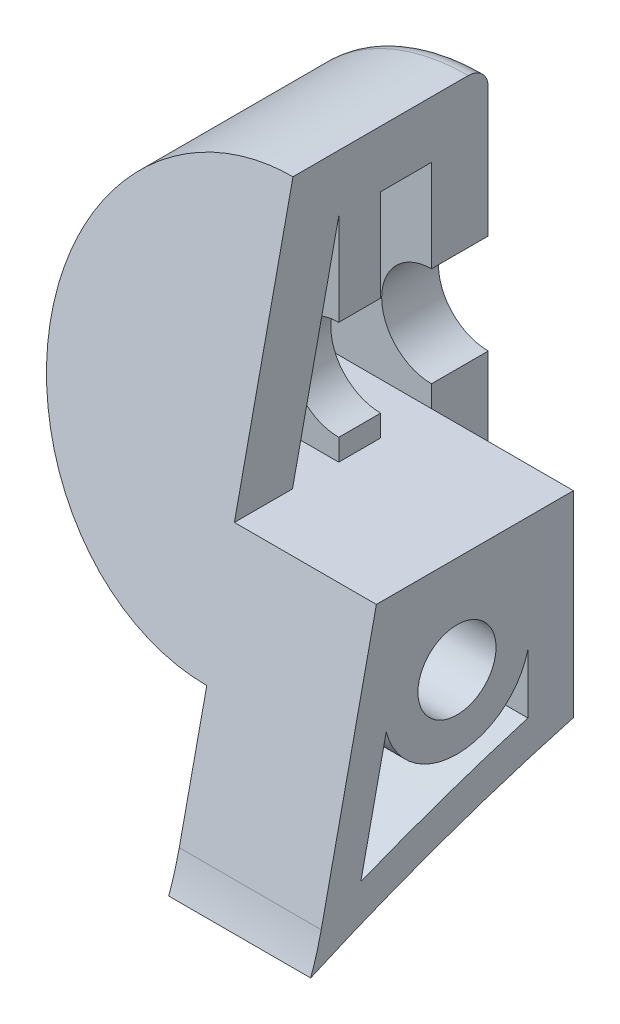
ISO-10303-21;
HEADER;
FILE_DESCRIPTION(('STEP AP214'),'2;1');
FILE_NAME('part.step','',(''),(''),'','','');
FILE_SCHEMA(('AUTOMOTIVE_DESIGN { 1 0 10303 214 1 1 1 1 }'));
ENDSEC;
DATA;
#1=APPLICATION_CONTEXT('core data for automotive mechanical design processes');
#2=APPLICATION_PROTOCOL_DEFINITION('international standard','automotive_design',2000,#1);
#3=PRODUCT_CONTEXT('',#1,'mechanical');
#4=PRODUCT('Part','Part','',(#3));
#5=PRODUCT_RELATED_PRODUCT_CATEGORY('part','',(#4));
#6=PRODUCT_DEFINITION_FORMATION('','',#4);
#7=PRODUCT_DEFINITION_CONTEXT('part definition',#1,'design');
#8=PRODUCT_DEFINITION('design','',#6,#7);
#9=PRODUCT_DEFINITION_SHAPE('','',#8);
#10=(LENGTH_UNIT() NAMED_UNIT(*) SI_UNIT(.MILLI.,.METRE.));
#11=(NAMED_UNIT(*) PLANE_ANGLE_UNIT() SI_UNIT($,.RADIAN.));
#12=(NAMED_UNIT(*) SI_UNIT($,.STERADIAN.) SOLID_ANGLE_UNIT());
#13=UNCERTAINTY_MEASURE_WITH_UNIT(LENGTH_MEASURE(1.E-05),#10,'distance_accuracy_value','');
#14=(GEOMETRIC_REPRESENTATION_CONTEXT(3) GLOBAL_UNCERTAINTY_ASSIGNED_CONTEXT((#13)) GLOBAL_UNIT_ASSIGNED_CONTEXT((#10,
#11,#12)) REPRESENTATION_CONTEXT('',''));
#15=CARTESIAN_POINT('',(0.,0.,0.));
#16=DIRECTION('',(0.,0.,1.));
#17=DIRECTION('',(1.,0.,0.));
#18=AXIS2_PLACEMENT_3D('',#15,#16,#17);
#19=CARTESIAN_POINT('',(0.,64.25,22.2295700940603));
#20=DIRECTION('',(1.,0.,0.));
#21=DIRECTION('',(0.,-1.,0.));
#22=AXIS2_PLACEMENT_3D('',#19,#20,#21);
#23=PLANE('',#22);
#24=DIRECTION('',(0.,-1.,0.));
#25=VECTOR('',#24,1.);
#26=CARTESIAN_POINT('',(0.,69.5,3.26415427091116));
#27=LINE('',#26,#25);
#28=CARTESIAN_POINT('',(0.,69.4965975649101,3.26415427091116));
#29=VERTEX_POINT('',#28);
#30=CARTESIAN_POINT('',(0.,68.7381583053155,3.26415427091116));
#31=VERTEX_POINT('',#30);
#32=EDGE_CURVE('E377',#29,#31,#27,.T.);
#33=ORIENTED_EDGE('',*,*,#32,.T.);
#34=DIRECTION('',(0.,0.,1.));
#35=VECTOR('',#34,1.);
#36=CARTESIAN_POINT('',(0.,68.7381583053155,6.93992804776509));
#37=LINE('',#36,#35);
#38=CARTESIAN_POINT('',(0.,68.7381583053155,1.7884345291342));
#39=VERTEX_POINT('',#38);
#40=EDGE_CURVE('E186',#39,#31,#37,.T.);
#41=ORIENTED_EDGE('',*,*,#40,.F.);
#42=DIRECTION('',(0.,1.,0.));
#43=VECTOR('',#42,1.);
#44=CARTESIAN_POINT('',(0.,76.25,1.7884345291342));
#45=LINE('',#44,#43);
#46=CARTESIAN_POINT('',(0.,69.4965975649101,1.7884345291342));
#47=VERTEX_POINT('',#46);
#48=EDGE_CURVE('E209',#39,#47,#45,.T.);
#49=ORIENTED_EDGE('',*,*,#48,.T.);
#50=DIRECTION('',(0.,0.,-1.));
#51=VECTOR('',#50,1.);
#52=CARTESIAN_POINT('',(0.,69.4965975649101,22.2295700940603));
#53=LINE('',#52,#51);
#54=EDGE_CURVE('E245',#29,#47,#53,.T.);
#55=ORIENTED_EDGE('',*,*,#54,.F.);
#56=EDGE_LOOP('',(#33,#41,#49,#55));
#57=FACE_BOUND('',#56,.T.);
#58=ADVANCED_FACE('F28',(#57),#23,.T.);
#59=CARTESIAN_POINT('',(0.,71.25,22.2295700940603));
#60=DIRECTION('',(0.,0.,-1.));
#61=DIRECTION('',(1.,0.,0.));
#62=AXIS2_PLACEMENT_3D('',#59,#60,#61);
#63=CYLINDRICAL_SURFACE('',#62,1.75340243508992);
#64=CARTESIAN_POINT('',(0.,71.25,3.26415427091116));
#65=DIRECTION('',(0.,0.,1.));
#66=DIRECTION('',(1.,0.,0.));
#67=AXIS2_PLACEMENT_3D('',#64,#65,#66);
#68=CIRCLE('',#67,1.75340243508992);
#69=CARTESIAN_POINT('',(0.,73.0034024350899,3.26415427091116));
#70=VERTEX_POINT('',#69);
#71=EDGE_CURVE('E194',#70,#29,#68,.T.);
#72=ORIENTED_EDGE('',*,*,#71,.T.);
#73=ORIENTED_EDGE('',*,*,#54,.T.);
#74=CARTESIAN_POINT('',(0.,71.25,1.7884345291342));
#75=DIRECTION('',(0.,0.,-1.));
#76=DIRECTION('',(0.,-1.,0.));
#77=AXIS2_PLACEMENT_3D('',#74,#75,#76);
#78=CIRCLE('',#77,1.75340243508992);
#79=CARTESIAN_POINT('',(0.,73.0034024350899,1.7884345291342));
#80=VERTEX_POINT('',#79);
#81=EDGE_CURVE('E225',#47,#80,#78,.T.);
#82=ORIENTED_EDGE('',*,*,#81,.T.);
#83=DIRECTION('',(0.,0.,-1.));
#84=VECTOR('',#83,1.);
#85=CARTESIAN_POINT('',(0.,73.0034024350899,22.2295700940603));
#86=LINE('',#85,#84);
#87=EDGE_CURVE('E241',#70,#80,#86,.T.);
#88=ORIENTED_EDGE('',*,*,#87,.F.);
#89=EDGE_LOOP('',(#72,#73,#82,#88));
#90=FACE_BOUND('',#89,.T.);
#91=ADVANCED_FACE('F372',(#90),#63,.F.);
#92=CARTESIAN_POINT('',(18.8000038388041,0.,-16.9));
#93=DIRECTION('',(-1.,0.,0.));
#94=DIRECTION('',(0.,0.,-1.));
#95=AXIS2_PLACEMENT_3D('',#92,#93,#94);
#96=CYLINDRICAL_SURFACE('',#95,64.0812271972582);
#97=CARTESIAN_POINT('',(5.,0.,-16.9));
#98=DIRECTION('',(1.,0.,0.));
#99=DIRECTION('',(0.,0.,-1.));
#100=AXIS2_PLACEMENT_3D('',#97,#98,#99);
#101=CIRCLE('',#100,64.0812271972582);
#102=CARTESIAN_POINT('',(5.,61.8125689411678,0.));
#103=VERTEX_POINT('',#102);
#104=CARTESIAN_POINT('',(5.,58.5009608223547,9.25418249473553));
#105=VERTEX_POINT('',#104);
#106=EDGE_CURVE('E303',#103,#105,#101,.T.);
#107=ORIENTED_EDGE('',*,*,#106,.T.);
#108=DIRECTION('',(-1.,0.,0.));
#109=VECTOR('',#108,1.);
#110=CARTESIAN_POINT('',(18.8000038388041,58.5009608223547,9.25418249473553));
#111=LINE('',#110,#109);
#112=CARTESIAN_POINT('',(0.,58.5009608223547,9.25418249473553));
#113=VERTEX_POINT('',#112);
#114=EDGE_CURVE('E295',#105,#113,#111,.T.);
#115=ORIENTED_EDGE('',*,*,#114,.T.);
#116=CARTESIAN_POINT('',(0.,0.,-16.9));
#117=DIRECTION('',(-1.,0.,0.));
#118=DIRECTION('',(0.,0.,-1.));
#119=AXIS2_PLACEMENT_3D('',#116,#117,#118);
#120=CIRCLE('',#119,64.0812271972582);
#121=CARTESIAN_POINT('',(0.,61.8125689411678,0.));
#122=VERTEX_POINT('',#121);
#123=EDGE_CURVE('E291',#113,#122,#120,.T.);
#124=ORIENTED_EDGE('',*,*,#123,.T.);
#125=DIRECTION('',(-1.,0.,0.));
#126=VECTOR('',#125,1.);
#127=CARTESIAN_POINT('',(18.8000038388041,61.8125689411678,0.));
#128=LINE('',#127,#126);
#129=EDGE_CURVE('E412',#103,#122,#128,.T.);
#130=ORIENTED_EDGE('',*,*,#129,.F.);
#131=EDGE_LOOP('',(#107,#115,#124,#130));
#132=FACE_BOUND('',#131,.T.);
#133=ADVANCED_FACE('F30',(#132),#96,.F.);
#134=CARTESIAN_POINT('',(18.8000038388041,59.787960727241,8.88116994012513));
#135=CARTESIAN_POINT('',(18.8000038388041,59.3477326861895,8.97665264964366));
#136=CARTESIAN_POINT('',(18.8000038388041,58.918820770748,9.1012164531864));
#137=CARTESIAN_POINT('',(18.8000038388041,58.5009608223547,9.25418249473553));
#138=B_SPLINE_CURVE_WITH_KNOTS('',3,(#134,#135,#136,#137),.UNSPECIFIED.,.F.,.F.,(4,4),(0.,1.),.UNSPECIFIED.);
#139=DIRECTION('',(-1.,0.,0.));
#140=VECTOR('',#139,1.);
#141=SURFACE_OF_LINEAR_EXTRUSION('',#138,#140);
#142=CARTESIAN_POINT('',(5.,59.787960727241,8.88116994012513));
#143=CARTESIAN_POINT('',(5.,59.3477326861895,8.97665264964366));
#144=CARTESIAN_POINT('',(5.,58.918820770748,9.1012164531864));
#145=CARTESIAN_POINT('',(5.,58.5009608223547,9.25418249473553));
#146=B_SPLINE_CURVE_WITH_KNOTS('',3,(#142,#143,#144,#145),.UNSPECIFIED.,.F.,.F.,(4,4),(0.,1.),.UNSPECIFIED.);
#147=CARTESIAN_POINT('',(5.,59.787960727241,8.88116994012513));
#148=VERTEX_POINT('',#147);
#149=EDGE_CURVE('E298',#105,#148,#146,.F.);
#150=ORIENTED_EDGE('',*,*,#149,.T.);
#151=DIRECTION('',(-1.,0.,0.));
#152=VECTOR('',#151,1.);
#153=CARTESIAN_POINT('',(18.8000038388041,59.787960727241,8.88116994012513));
#154=LINE('',#153,#152);
#155=CARTESIAN_POINT('',(0.,59.787960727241,8.88116994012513));
#156=VERTEX_POINT('',#155);
#157=EDGE_CURVE('E409',#148,#156,#154,.T.);
#158=ORIENTED_EDGE('',*,*,#157,.T.);
#159=CARTESIAN_POINT('',(0.,59.787960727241,8.88116994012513));
#160=CARTESIAN_POINT('',(0.,59.3477326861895,8.97665264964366));
#161=CARTESIAN_POINT('',(0.,58.918820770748,9.1012164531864));
#162=CARTESIAN_POINT('',(0.,58.5009608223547,9.25418249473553));
#163=B_SPLINE_CURVE_WITH_KNOTS('',3,(#159,#160,#161,#162),.UNSPECIFIED.,.F.,.F.,(4,4),(0.,1.),.UNSPECIFIED.);
#164=EDGE_CURVE('E353',#156,#113,#163,.T.);
#165=ORIENTED_EDGE('',*,*,#164,.T.);
#166=ORIENTED_EDGE('',*,*,#114,.F.);
#167=EDGE_LOOP('',(#150,#158,#165,#166));
#168=FACE_BOUND('',#167,.T.);
#169=ADVANCED_FACE('F325',(#168),#141,.F.);
#170=CARTESIAN_POINT('',(18.8000038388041,64.25,7.91338152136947));
#171=DIRECTION('',(0.,0.211965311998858,0.977277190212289));
#172=DIRECTION('',(0.,-0.977277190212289,0.211965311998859));
#173=AXIS2_PLACEMENT_3D('',#170,#171,#172);
#174=PLANE('',#173);
#175=CARTESIAN_POINT('',(0.,71.25,6.39512528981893));
#176=DIRECTION('',(0.,-0.211965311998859,-0.977277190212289));
#177=DIRECTION('',(0.,0.977277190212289,-0.211965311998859));
#178=AXIS2_PLACEMENT_3D('',#175,#176,#177);
#179=ELLIPSE('',#178,7.16275798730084,6.99999999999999);
#180=CARTESIAN_POINT('',(0.,78.25,4.87686905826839));
#181=VERTEX_POINT('',#180);
#182=CARTESIAN_POINT('',(0.,64.25,7.91338152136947));
#183=VERTEX_POINT('',#182);
#184=EDGE_CURVE('E253',#181,#183,#179,.F.);
#185=ORIENTED_EDGE('',*,*,#184,.T.);
#186=DIRECTION('',(0.,-0.977277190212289,0.211965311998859));
#187=VECTOR('',#186,1.);
#188=CARTESIAN_POINT('',(0.,64.25,7.91338152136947));
#189=LINE('',#188,#187);
#190=EDGE_CURVE('E314',#183,#156,#189,.T.);
#191=ORIENTED_EDGE('',*,*,#190,.T.);
#192=ORIENTED_EDGE('',*,*,#157,.F.);
#193=DIRECTION('',(0.,0.977277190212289,-0.211965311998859));
#194=VECTOR('',#193,1.);
#195=CARTESIAN_POINT('',(5.,64.25,7.91338152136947));
#196=LINE('',#195,#194);
#197=CARTESIAN_POINT('',(5.,68.7381583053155,6.93992804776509));
#198=VERTEX_POINT('',#197);
#199=EDGE_CURVE('E294',#148,#198,#196,.T.);
#200=ORIENTED_EDGE('',*,*,#199,.T.);
#201=DIRECTION('',(-1.,0.,0.));
#202=VECTOR('',#201,1.);
#203=CARTESIAN_POINT('',(18.8000038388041,68.7381583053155,6.93992804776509));
#204=LINE('',#203,#202);
#205=CARTESIAN_POINT('',(0.,68.7381583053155,6.93992804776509));
#206=VERTEX_POINT('',#205);
#207=EDGE_CURVE('E319',#198,#206,#204,.T.);
#208=ORIENTED_EDGE('',*,*,#207,.T.);
#209=DIRECTION('',(0.,0.977277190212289,-0.211965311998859));
#210=VECTOR('',#209,1.);
#211=CARTESIAN_POINT('',(0.,61.2844177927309,8.55659775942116));
#212=LINE('',#211,#210);
#213=EDGE_CURVE('E182',#206,#181,#212,.T.);
#214=ORIENTED_EDGE('',*,*,#213,.T.);
#215=EDGE_LOOP('',(#185,#191,#192,#200,#208,#214));
#216=FACE_BOUND('',#215,.T.);
#217=ADVANCED_FACE('F330',(#216),#174,.T.);
#218=CARTESIAN_POINT('',(18.8000038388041,68.7381583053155,6.93992804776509));
#219=DIRECTION('',(0.,1.,0.));
#220=DIRECTION('',(0.,0.,1.));
#221=AXIS2_PLACEMENT_3D('',#218,#219,#220);
#222=PLANE('',#221);
#223=DIRECTION('',(0.,0.,-1.));
#224=VECTOR('',#223,1.);
#225=CARTESIAN_POINT('',(5.,68.7381583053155,6.93992804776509));
#226=LINE('',#225,#224);
#227=CARTESIAN_POINT('',(5.,68.7381583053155,0.));
#228=VERTEX_POINT('',#227);
#229=EDGE_CURVE('E292',#198,#228,#226,.T.);
#230=ORIENTED_EDGE('',*,*,#229,.T.);
#231=DIRECTION('',(-1.,0.,0.));
#232=VECTOR('',#231,1.);
#233=CARTESIAN_POINT('',(18.8000038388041,68.7381583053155,0.));
#234=LINE('',#233,#232);
#235=CARTESIAN_POINT('',(0.,68.7381583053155,0.));
#236=VERTEX_POINT('',#235);
#237=EDGE_CURVE('E410',#228,#236,#234,.T.);
#238=ORIENTED_EDGE('',*,*,#237,.T.);
#239=DIRECTION('',(1.,0.,0.));
#240=VECTOR('',#239,1.);
#241=CARTESIAN_POINT('',(-11.001,68.7381583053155,0.));
#242=LINE('',#241,#240);
#243=CARTESIAN_POINT('',(-4.32326858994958,68.7381583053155,0.));
#244=VERTEX_POINT('',#243);
#245=EDGE_CURVE('E218',#244,#236,#242,.T.);
#246=ORIENTED_EDGE('',*,*,#245,.F.);
#247=DIRECTION('',(0.,0.,-1.));
#248=VECTOR('',#247,1.);
#249=CARTESIAN_POINT('',(-4.32326858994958,68.7381583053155,22.2295700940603));
#250=LINE('',#249,#248);
#251=CARTESIAN_POINT('',(-4.32326858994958,68.7381583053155,1.7884345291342));
#252=VERTEX_POINT('',#251);
#253=EDGE_CURVE('E196',#244,#252,#250,.F.);
#254=ORIENTED_EDGE('',*,*,#253,.T.);
#255=DIRECTION('',(1.,0.,0.));
#256=VECTOR('',#255,1.);
#257=CARTESIAN_POINT('',(-11.001,68.7381583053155,1.7884345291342));
#258=LINE('',#257,#256);
#259=EDGE_CURVE('E219',#252,#39,#258,.T.);
#260=ORIENTED_EDGE('',*,*,#259,.T.);
#261=ORIENTED_EDGE('',*,*,#40,.T.);
#262=DIRECTION('',(1.,0.,0.));
#263=VECTOR('',#262,1.);
#264=CARTESIAN_POINT('',(-11.001,68.7381583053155,3.26415427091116));
#265=LINE('',#264,#263);
#266=CARTESIAN_POINT('',(-4.32326858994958,68.7381583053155,3.26415427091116));
#267=VERTEX_POINT('',#266);
#268=EDGE_CURVE('E198',#267,#31,#265,.T.);
#269=ORIENTED_EDGE('',*,*,#268,.F.);
#270=DIRECTION('',(0.,0.,-1.));
#271=VECTOR('',#270,1.);
#272=CARTESIAN_POINT('',(-4.32326858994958,68.7381583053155,22.2295700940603));
#273=LINE('',#272,#271);
#274=CARTESIAN_POINT('',(-4.32326858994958,68.7381583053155,4.89342576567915));
#275=VERTEX_POINT('',#274);
#276=EDGE_CURVE('E193',#267,#275,#273,.F.);
#277=ORIENTED_EDGE('',*,*,#276,.T.);
#278=DIRECTION('',(1.,0.,0.));
#279=VECTOR('',#278,1.);
#280=CARTESIAN_POINT('',(-11.001,68.7381583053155,4.89342576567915));
#281=LINE('',#280,#279);
#282=CARTESIAN_POINT('',(0.,68.7381583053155,4.89342576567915));
#283=VERTEX_POINT('',#282);
#284=EDGE_CURVE('E174',#275,#283,#281,.T.);
#285=ORIENTED_EDGE('',*,*,#284,.T.);
#286=EDGE_CURVE('E179',#283,#206,#37,.T.);
#287=ORIENTED_EDGE('',*,*,#286,.T.);
#288=ORIENTED_EDGE('',*,*,#207,.F.);
#289=EDGE_LOOP('',(#230,#238,#246,#254,#260,#261,#269,#277,#285,#287,#288));
#290=FACE_BOUND('',#289,.T.);
#291=ADVANCED_FACE('F190',(#290),#222,.T.);
#292=CARTESIAN_POINT('',(18.8000038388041,68.7381583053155,0.));
#293=DIRECTION('',(0.,0.,-1.));
#294=DIRECTION('',(0.,1.,0.));
#295=AXIS2_PLACEMENT_3D('',#292,#293,#294);
#296=PLANE('',#295);
#297=DIRECTION('',(0.,-1.,0.));
#298=VECTOR('',#297,1.);
#299=CARTESIAN_POINT('',(5.,68.7381583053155,0.));
#300=LINE('',#299,#298);
#301=EDGE_CURVE('E309',#228,#103,#300,.T.);
#302=ORIENTED_EDGE('',*,*,#301,.T.);
#303=ORIENTED_EDGE('',*,*,#129,.T.);
#304=DIRECTION('',(0.,1.,0.));
#305=VECTOR('',#304,1.);
#306=CARTESIAN_POINT('',(0.,68.7381583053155,0.));
#307=LINE('',#306,#305);
#308=CARTESIAN_POINT('',(0.,64.25,0.));
#309=VERTEX_POINT('',#308);
#310=EDGE_CURVE('E187',#122,#309,#307,.T.);
#311=ORIENTED_EDGE('',*,*,#310,.T.);
#312=EDGE_CURVE('E311',#309,#236,#307,.T.);
#313=ORIENTED_EDGE('',*,*,#312,.T.);
#314=ORIENTED_EDGE('',*,*,#237,.F.);
#315=EDGE_LOOP('',(#302,#303,#311,#313,#314));
#316=FACE_BOUND('',#315,.T.);
#317=ADVANCED_FACE('F424',(#316),#296,.T.);
#318=CARTESIAN_POINT('',(0.,0.,-16.9));
#319=DIRECTION('',(-1.,0.,0.));
#320=DIRECTION('',(0.,0.,-1.));
#321=AXIS2_PLACEMENT_3D('',#318,#319,#320);
#322=PLANE('',#321);
#323=DIRECTION('',(0.,0.,-1.));
#324=VECTOR('',#323,1.);
#325=CARTESIAN_POINT('',(0.,64.25,22.2295700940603));
#326=LINE('',#325,#324);
#327=EDGE_CURVE('E249',#183,#309,#326,.T.);
#328=ORIENTED_EDGE('',*,*,#327,.T.);
#329=ORIENTED_EDGE('',*,*,#310,.F.);
#330=ORIENTED_EDGE('',*,*,#123,.F.);
#331=ORIENTED_EDGE('',*,*,#164,.F.);
#332=ORIENTED_EDGE('',*,*,#190,.F.);
#333=EDGE_LOOP('',(#328,#329,#330,#331,#332));
#334=FACE_BOUND('',#333,.T.);
#335=ADVANCED_FACE('F332',(#334),#322,.T.);
#336=CARTESIAN_POINT('',(5.,65.3235808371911,4.1));
#337=DIRECTION('',(-1.,0.,0.));
#338=DIRECTION('',(0.,0.,-1.));
#339=AXIS2_PLACEMENT_3D('',#336,#337,#338);
#340=PLANE('',#339);
#341=DIRECTION('',(0.,-1.,0.));
#342=VECTOR('',#341,1.);
#343=CARTESIAN_POINT('',(5.,64.6944095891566,1.60304815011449));
#344=LINE('',#343,#342);
#345=CARTESIAN_POINT('',(5.,64.6944095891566,1.60304815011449));
#346=VERTEX_POINT('',#345);
#347=CARTESIAN_POINT('',(5.,62.6041199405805,1.60304815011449));
#348=VERTEX_POINT('',#347);
#349=EDGE_CURVE('E259',#346,#348,#344,.T.);
#350=ORIENTED_EDGE('',*,*,#349,.T.);
#351=CARTESIAN_POINT('',(5.,0.,-16.9));
#352=DIRECTION('',(1.,0.,0.));
#353=DIRECTION('',(0.,0.,1.));
#354=AXIS2_PLACEMENT_3D('',#351,#352,#353);
#355=CIRCLE('',#354,65.2812271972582);
#356=CARTESIAN_POINT('',(5.,60.5550867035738,7.48688374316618));
#357=VERTEX_POINT('',#356);
#358=EDGE_CURVE('E262',#348,#357,#355,.T.);
#359=ORIENTED_EDGE('',*,*,#358,.T.);
#360=DIRECTION('',(0.,0.977277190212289,-0.21196531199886));
#361=VECTOR('',#360,1.);
#362=CARTESIAN_POINT('',(5.,64.6777689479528,6.5926997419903));
#363=LINE('',#362,#361);
#364=CARTESIAN_POINT('',(5.,64.6777689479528,6.5926997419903));
#365=VERTEX_POINT('',#364);
#366=EDGE_CURVE('E265',#357,#365,#363,.T.);
#367=ORIENTED_EDGE('',*,*,#366,.T.);
#368=CARTESIAN_POINT('',(5.,65.3235808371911,4.1));
#369=DIRECTION('',(1.,0.,0.));
#370=DIRECTION('',(0.,0.,1.));
#371=AXIS2_PLACEMENT_3D('',#368,#369,#370);
#372=CIRCLE('',#371,2.57500000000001);
#373=EDGE_CURVE('E256',#365,#346,#372,.T.);
#374=ORIENTED_EDGE('',*,*,#373,.T.);
#375=EDGE_LOOP('',(#350,#359,#367,#374));
#376=FACE_BOUND('',#375,.T.);
#377=CARTESIAN_POINT('',(5.,65.3235808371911,4.1));
#378=DIRECTION('',(-1.,0.,0.));
#379=DIRECTION('',(0.,0.,1.));
#380=AXIS2_PLACEMENT_3D('',#377,#378,#379);
#381=CIRCLE('',#380,1.37500000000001);
#382=CARTESIAN_POINT('',(5.,65.3235808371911,5.47500000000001));
#383=VERTEX_POINT('',#382);
#384=EDGE_CURVE('E280',#383,#383,#381,.T.);
#385=ORIENTED_EDGE('',*,*,#384,.T.);
#386=EDGE_LOOP('',(#385));
#387=FACE_BOUND('',#386,.T.);
#388=ORIENTED_EDGE('',*,*,#106,.F.);
#389=ORIENTED_EDGE('',*,*,#301,.F.);
#390=ORIENTED_EDGE('',*,*,#229,.F.);
#391=ORIENTED_EDGE('',*,*,#199,.F.);
#392=ORIENTED_EDGE('',*,*,#149,.F.);
#393=EDGE_LOOP('',(#388,#389,#390,#391,#392));
#394=FACE_BOUND('',#393,.T.);
#395=ADVANCED_FACE('F432',(#376,#387,#394),#340,.F.);
#396=CARTESIAN_POINT('',(1.5,65.3235808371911,4.1));
#397=DIRECTION('',(1.,0.,0.));
#398=DIRECTION('',(0.,0.,1.));
#399=AXIS2_PLACEMENT_3D('',#396,#397,#398);
#400=CYLINDRICAL_SURFACE('',#399,1.37500000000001);
#401=CARTESIAN_POINT('',(1.5,65.3235808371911,4.1));
#402=DIRECTION('',(-1.,0.,0.));
#403=DIRECTION('',(0.,0.,1.));
#404=AXIS2_PLACEMENT_3D('',#401,#402,#403);
#405=CIRCLE('',#404,1.37500000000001);
#406=CARTESIAN_POINT('',(1.5,65.3235808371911,5.47500000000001));
#407=VERTEX_POINT('',#406);
#408=EDGE_CURVE('E288',#407,#407,#405,.T.);
#409=ORIENTED_EDGE('',*,*,#408,.T.);
#410=EDGE_LOOP('',(#409));
#411=FACE_BOUND('',#410,.T.);
#412=ORIENTED_EDGE('',*,*,#384,.F.);
#413=EDGE_LOOP('',(#412));
#414=FACE_BOUND('',#413,.T.);
#415=ADVANCED_FACE('F585',(#411,#414),#400,.F.);
#416=CARTESIAN_POINT('',(1.5,65.3235808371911,4.1));
#417=DIRECTION('',(1.,0.,0.));
#418=DIRECTION('',(0.,0.,1.));
#419=AXIS2_PLACEMENT_3D('',#416,#417,#418);
#420=PLANE('',#419);
#421=ORIENTED_EDGE('',*,*,#408,.F.);
#422=EDGE_LOOP('',(#421));
#423=FACE_BOUND('',#422,.T.);
#424=ADVANCED_FACE('F577',(#423),#420,.T.);
#425=CARTESIAN_POINT('',(1.5,65.3235808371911,4.1));
#426=DIRECTION('',(1.,0.,0.));
#427=DIRECTION('',(0.,0.,1.));
#428=AXIS2_PLACEMENT_3D('',#425,#426,#427);
#429=CYLINDRICAL_SURFACE('',#428,2.57500000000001);
#430=ORIENTED_EDGE('',*,*,#373,.F.);
#431=DIRECTION('',(1.,0.,0.));
#432=VECTOR('',#431,1.);
#433=CARTESIAN_POINT('',(1.5,64.6777689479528,6.5926997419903));
#434=LINE('',#433,#432);
#435=CARTESIAN_POINT('',(1.5,64.6777689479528,6.5926997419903));
#436=VERTEX_POINT('',#435);
#437=EDGE_CURVE('E278',#436,#365,#434,.T.);
#438=ORIENTED_EDGE('',*,*,#437,.F.);
#439=CARTESIAN_POINT('',(1.5,65.3235808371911,4.1));
#440=DIRECTION('',(1.,0.,0.));
#441=DIRECTION('',(0.,0.,1.));
#442=AXIS2_PLACEMENT_3D('',#439,#440,#441);
#443=CIRCLE('',#442,2.57500000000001);
#444=CARTESIAN_POINT('',(1.5,64.6944095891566,1.60304815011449));
#445=VERTEX_POINT('',#444);
#446=EDGE_CURVE('E268',#436,#445,#443,.T.);
#447=ORIENTED_EDGE('',*,*,#446,.T.);
#448=DIRECTION('',(1.,0.,0.));
#449=VECTOR('',#448,1.);
#450=CARTESIAN_POINT('',(1.5,64.6944095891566,1.60304815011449));
#451=LINE('',#450,#449);
#452=EDGE_CURVE('E277',#445,#346,#451,.T.);
#453=ORIENTED_EDGE('',*,*,#452,.T.);
#454=EDGE_LOOP('',(#430,#438,#447,#453));
#455=FACE_BOUND('',#454,.T.);
#456=ADVANCED_FACE('F569',(#455),#429,.T.);
#457=CARTESIAN_POINT('',(1.5,64.6777689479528,6.5926997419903));
#458=DIRECTION('',(0.,0.21196531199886,0.977277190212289));
#459=DIRECTION('',(0.,-0.977277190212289,0.21196531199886));
#460=AXIS2_PLACEMENT_3D('',#457,#458,#459);
#461=PLANE('',#460);
#462=ORIENTED_EDGE('',*,*,#366,.F.);
#463=DIRECTION('',(1.,0.,0.));
#464=VECTOR('',#463,1.);
#465=CARTESIAN_POINT('',(1.5,60.5550867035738,7.48688374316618));
#466=LINE('',#465,#464);
#467=CARTESIAN_POINT('',(1.5,60.5550867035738,7.48688374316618));
#468=VERTEX_POINT('',#467);
#469=EDGE_CURVE('E281',#468,#357,#466,.T.);
#470=ORIENTED_EDGE('',*,*,#469,.F.);
#471=DIRECTION('',(0.,0.977277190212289,-0.21196531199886));
#472=VECTOR('',#471,1.);
#473=CARTESIAN_POINT('',(1.5,64.6777689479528,6.5926997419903));
#474=LINE('',#473,#472);
#475=EDGE_CURVE('E275',#468,#436,#474,.T.);
#476=ORIENTED_EDGE('',*,*,#475,.T.);
#477=ORIENTED_EDGE('',*,*,#437,.T.);
#478=EDGE_LOOP('',(#462,#470,#476,#477));
#479=FACE_BOUND('',#478,.T.);
#480=ADVANCED_FACE('F561',(#479),#461,.F.);
#481=CARTESIAN_POINT('',(1.5,0.,-16.9));
#482=DIRECTION('',(1.,0.,0.));
#483=DIRECTION('',(0.,0.,1.));
#484=AXIS2_PLACEMENT_3D('',#481,#482,#483);
#485=CYLINDRICAL_SURFACE('',#484,65.2812271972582);
#486=ORIENTED_EDGE('',*,*,#358,.F.);
#487=DIRECTION('',(1.,0.,0.));
#488=VECTOR('',#487,1.);
#489=CARTESIAN_POINT('',(1.5,62.6041199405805,1.60304815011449));
#490=LINE('',#489,#488);
#491=CARTESIAN_POINT('',(1.5,62.6041199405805,1.60304815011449));
#492=VERTEX_POINT('',#491);
#493=EDGE_CURVE('E283',#492,#348,#490,.T.);
#494=ORIENTED_EDGE('',*,*,#493,.F.);
#495=CARTESIAN_POINT('',(1.5,0.,-16.9));
#496=DIRECTION('',(1.,0.,0.));
#497=DIRECTION('',(0.,0.,1.));
#498=AXIS2_PLACEMENT_3D('',#495,#496,#497);
#499=CIRCLE('',#498,65.2812271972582);
#500=EDGE_CURVE('E273',#492,#468,#499,.T.);
#501=ORIENTED_EDGE('',*,*,#500,.T.);
#502=ORIENTED_EDGE('',*,*,#469,.T.);
#503=EDGE_LOOP('',(#486,#494,#501,#502));
#504=FACE_BOUND('',#503,.T.);
#505=ADVANCED_FACE('F553',(#504),#485,.T.);
#506=CARTESIAN_POINT('',(1.5,64.6944095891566,1.60304815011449));
#507=DIRECTION('',(0.,0.,-1.));
#508=DIRECTION('',(1.,0.,0.));
#509=AXIS2_PLACEMENT_3D('',#506,#507,#508);
#510=PLANE('',#509);
#511=ORIENTED_EDGE('',*,*,#349,.F.);
#512=ORIENTED_EDGE('',*,*,#452,.F.);
#513=DIRECTION('',(0.,-1.,0.));
#514=VECTOR('',#513,1.);
#515=CARTESIAN_POINT('',(1.5,64.6944095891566,1.60304815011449));
#516=LINE('',#515,#514);
#517=EDGE_CURVE('E271',#445,#492,#516,.T.);
#518=ORIENTED_EDGE('',*,*,#517,.T.);
#519=ORIENTED_EDGE('',*,*,#493,.T.);
#520=EDGE_LOOP('',(#511,#512,#518,#519));
#521=FACE_BOUND('',#520,.T.);
#522=ADVANCED_FACE('F545',(#521),#510,.F.);
#523=CARTESIAN_POINT('',(1.5,65.3235808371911,4.1));
#524=DIRECTION('',(1.,0.,0.));
#525=DIRECTION('',(0.,0.,1.));
#526=AXIS2_PLACEMENT_3D('',#523,#524,#525);
#527=PLANE('',#526);
#528=ORIENTED_EDGE('',*,*,#446,.F.);
#529=ORIENTED_EDGE('',*,*,#475,.F.);
#530=ORIENTED_EDGE('',*,*,#500,.F.);
#531=ORIENTED_EDGE('',*,*,#517,.F.);
#532=EDGE_LOOP('',(#528,#529,#530,#531));
#533=FACE_BOUND('',#532,.T.);
#534=ADVANCED_FACE('F445',(#533),#527,.T.);
#535=CARTESIAN_POINT('',(0.,71.25,-2.));
#536=DIRECTION('',(0.,0.,-1.));
#537=DIRECTION('',(1.,0.,0.));
#538=AXIS2_PLACEMENT_3D('',#535,#536,#537);
#539=PLANE('',#538);
#540=DIRECTION('',(0.,1.,0.));
#541=VECTOR('',#540,1.);
#542=CARTESIAN_POINT('',(0.,73.0034024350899,-2.));
#543=LINE('',#542,#541);
#544=CARTESIAN_POINT('',(0.,73.0034024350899,-2.));
#545=VERTEX_POINT('',#544);
#546=CARTESIAN_POINT('',(0.,77.55,-2.));
#547=VERTEX_POINT('',#546);
#548=EDGE_CURVE('E234',#545,#547,#543,.T.);
#549=ORIENTED_EDGE('',*,*,#548,.F.);
#550=CARTESIAN_POINT('',(0.,71.25,-2.));
#551=DIRECTION('',(0.,0.,-1.));
#552=DIRECTION('',(1.,0.,0.));
#553=AXIS2_PLACEMENT_3D('',#550,#551,#552);
#554=CIRCLE('',#553,1.75340243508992);
#555=CARTESIAN_POINT('',(0.,69.4965975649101,-2.));
#556=VERTEX_POINT('',#555);
#557=EDGE_CURVE('E231',#556,#545,#554,.T.);
#558=ORIENTED_EDGE('',*,*,#557,.F.);
#559=DIRECTION('',(0.,1.,0.));
#560=VECTOR('',#559,1.);
#561=CARTESIAN_POINT('',(0.,64.25,-2.));
#562=LINE('',#561,#560);
#563=CARTESIAN_POINT('',(0.,64.95,-2.));
#564=VERTEX_POINT('',#563);
#565=EDGE_CURVE('E228',#564,#556,#562,.T.);
#566=ORIENTED_EDGE('',*,*,#565,.F.);
#567=CARTESIAN_POINT('',(0.,71.25,-2.));
#568=DIRECTION('',(0.,0.,1.));
#569=DIRECTION('',(1.,0.,0.));
#570=AXIS2_PLACEMENT_3D('',#567,#568,#569);
#571=CIRCLE('',#570,6.29999999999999);
#572=EDGE_CURVE('E356',#547,#564,#571,.T.);
#573=ORIENTED_EDGE('',*,*,#572,.F.);
#574=EDGE_LOOP('',(#549,#558,#566,#573));
#575=FACE_BOUND('',#574,.T.);
#576=ADVANCED_FACE('F397',(#575),#539,.T.);
#577=DIRECTION('',(0.,-1.,0.));
#578=VECTOR('',#577,1.);
#579=CARTESIAN_POINT('',(0.,73.,0.));
#580=LINE('',#579,#578);
#581=CARTESIAN_POINT('',(0.,69.4965975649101,0.));
#582=VERTEX_POINT('',#581);
#583=EDGE_CURVE('E215',#582,#236,#580,.T.);
#584=ORIENTED_EDGE('',*,*,#583,.T.);
#585=ORIENTED_EDGE('',*,*,#312,.F.);
#586=CARTESIAN_POINT('',(0.,64.25,-1.29999999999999));
#587=VERTEX_POINT('',#586);
#588=EDGE_CURVE('E237',#309,#587,#326,.T.);
#589=ORIENTED_EDGE('',*,*,#588,.T.);
#590=CARTESIAN_POINT('',(0.,64.95,-1.3));
#591=DIRECTION('',(-1.,0.,0.));
#592=DIRECTION('',(0.,-1.,0.));
#593=AXIS2_PLACEMENT_3D('',#590,#591,#592);
#594=CIRCLE('',#593,0.7);
#595=EDGE_CURVE('E359',#564,#587,#594,.T.);
#596=ORIENTED_EDGE('',*,*,#595,.F.);
#597=ORIENTED_EDGE('',*,*,#565,.T.);
#598=EDGE_CURVE('E248',#582,#556,#53,.T.);
#599=ORIENTED_EDGE('',*,*,#598,.F.);
#600=EDGE_LOOP('',(#584,#585,#589,#596,#597,#599));
#601=FACE_BOUND('',#600,.T.);
#602=ADVANCED_FACE('F437',(#601),#23,.T.);
#603=CARTESIAN_POINT('',(0.,71.25,0.));
#604=DIRECTION('',(0.,0.,1.));
#605=DIRECTION('',(0.,1.,0.));
#606=AXIS2_PLACEMENT_3D('',#603,#604,#605);
#607=CIRCLE('',#606,1.75340243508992);
#608=CARTESIAN_POINT('',(0.,73.0034024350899,0.));
#609=VERTEX_POINT('',#608);
#610=EDGE_CURVE('E221',#609,#582,#607,.T.);
#611=ORIENTED_EDGE('',*,*,#610,.T.);
#612=ORIENTED_EDGE('',*,*,#598,.T.);
#613=ORIENTED_EDGE('',*,*,#557,.T.);
#614=EDGE_CURVE('E244',#609,#545,#86,.T.);
#615=ORIENTED_EDGE('',*,*,#614,.F.);
#616=EDGE_LOOP('',(#611,#612,#613,#615));
#617=FACE_BOUND('',#616,.T.);
#618=ADVANCED_FACE('F390',(#617),#63,.F.);
#619=CARTESIAN_POINT('',(0.,73.0034024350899,22.2295700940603));
#620=DIRECTION('',(1.,0.,0.));
#621=DIRECTION('',(0.,-1.,0.));
#622=AXIS2_PLACEMENT_3D('',#619,#620,#621);
#623=PLANE('',#622);
#624=CARTESIAN_POINT('',(0.,76.25,3.26415427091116));
#625=VERTEX_POINT('',#624);
#626=EDGE_CURVE('E477',#625,#70,#27,.T.);
#627=ORIENTED_EDGE('',*,*,#626,.T.);
#628=ORIENTED_EDGE('',*,*,#87,.T.);
#629=DIRECTION('',(0.,1.,0.));
#630=VECTOR('',#629,1.);
#631=CARTESIAN_POINT('',(0.,73.0034024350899,1.7884345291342));
#632=LINE('',#631,#630);
#633=CARTESIAN_POINT('',(0.,76.25,1.7884345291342));
#634=VERTEX_POINT('',#633);
#635=EDGE_CURVE('E36',#80,#634,#632,.T.);
#636=ORIENTED_EDGE('',*,*,#635,.T.);
#637=DIRECTION('',(0.,0.,-1.));
#638=VECTOR('',#637,1.);
#639=CARTESIAN_POINT('',(0.,76.25,1.7884345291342));
#640=LINE('',#639,#638);
#641=CARTESIAN_POINT('',(0.,76.25,0.));
#642=VERTEX_POINT('',#641);
#643=EDGE_CURVE('E212',#634,#642,#640,.T.);
#644=ORIENTED_EDGE('',*,*,#643,.T.);
#645=EDGE_CURVE('E216',#642,#609,#580,.T.);
#646=ORIENTED_EDGE('',*,*,#645,.T.);
#647=ORIENTED_EDGE('',*,*,#614,.T.);
#648=ORIENTED_EDGE('',*,*,#548,.T.);
#649=CARTESIAN_POINT('',(0.,77.55,-1.3));
#650=DIRECTION('',(-1.,0.,0.));
#651=DIRECTION('',(0.,-1.,0.));
#652=AXIS2_PLACEMENT_3D('',#649,#650,#651);
#653=CIRCLE('',#652,0.7);
#654=CARTESIAN_POINT('',(0.,78.25,-1.29999999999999));
#655=VERTEX_POINT('',#654);
#656=EDGE_CURVE('E364',#655,#547,#653,.T.);
#657=ORIENTED_EDGE('',*,*,#656,.F.);
#658=DIRECTION('',(0.,0.,-1.));
#659=VECTOR('',#658,1.);
#660=CARTESIAN_POINT('',(0.,78.25,22.2295700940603));
#661=LINE('',#660,#659);
#662=EDGE_CURVE('E238',#181,#655,#661,.T.);
#663=ORIENTED_EDGE('',*,*,#662,.F.);
#664=ORIENTED_EDGE('',*,*,#213,.F.);
#665=ORIENTED_EDGE('',*,*,#286,.F.);
#666=DIRECTION('',(0.,0.977277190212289,-0.21196531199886));
#667=VECTOR('',#666,1.);
#668=CARTESIAN_POINT('',(0.,69.220605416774,4.7887860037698));
#669=LINE('',#668,#667);
#670=EDGE_CURVE('E12',#283,#625,#669,.T.);
#671=ORIENTED_EDGE('',*,*,#670,.T.);
#672=EDGE_LOOP('',(#627,#628,#636,#644,#646,#647,#648,#657,#663,#664,#665,#671));
#673=FACE_BOUND('',#672,.T.);
#674=ADVANCED_FACE('F180',(#673),#623,.T.);
#675=CARTESIAN_POINT('',(0.,71.25,22.2295700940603));
#676=DIRECTION('',(0.,0.,-1.));
#677=DIRECTION('',(1.,0.,0.));
#678=AXIS2_PLACEMENT_3D('',#675,#676,#677);
#679=CYLINDRICAL_SURFACE('',#678,6.99999999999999);
#680=ORIENTED_EDGE('',*,*,#588,.F.);
#681=ORIENTED_EDGE('',*,*,#327,.F.);
#682=ORIENTED_EDGE('',*,*,#184,.F.);
#683=ORIENTED_EDGE('',*,*,#662,.T.);
#684=CARTESIAN_POINT('',(0.,71.25,-1.3));
#685=DIRECTION('',(0.,0.,1.));
#686=DIRECTION('',(1.,0.,0.));
#687=AXIS2_PLACEMENT_3D('',#684,#685,#686);
#688=CIRCLE('',#687,6.99999999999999);
#689=EDGE_CURVE('E362',#587,#655,#688,.F.);
#690=ORIENTED_EDGE('',*,*,#689,.F.);
#691=EDGE_LOOP('',(#680,#681,#682,#683,#690));
#692=FACE_BOUND('',#691,.T.);
#693=ADVANCED_FACE('F404',(#692),#679,.T.);
#694=CARTESIAN_POINT('',(0.,71.25,-1.3));
#695=DIRECTION('',(0.,0.,-1.));
#696=DIRECTION('',(1.,0.,0.));
#697=AXIS2_PLACEMENT_3D('',#694,#695,#696);
#698=TOROIDAL_SURFACE('',#697,6.29999999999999,0.7);
#699=ORIENTED_EDGE('',*,*,#656,.T.);
#700=ORIENTED_EDGE('',*,*,#572,.T.);
#701=ORIENTED_EDGE('',*,*,#595,.T.);
#702=ORIENTED_EDGE('',*,*,#689,.T.);
#703=EDGE_LOOP('',(#699,#700,#701,#702));
#704=FACE_BOUND('',#703,.T.);
#705=ADVANCED_FACE('F400',(#704),#698,.T.);
#706=CARTESIAN_POINT('',(-11.001,76.25,1.7884345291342));
#707=DIRECTION('',(0.,0.,1.));
#708=DIRECTION('',(0.,-1.,0.));
#709=AXIS2_PLACEMENT_3D('',#706,#707,#708);
#710=PLANE('',#709);
#711=ORIENTED_EDGE('',*,*,#81,.F.);
#712=ORIENTED_EDGE('',*,*,#48,.F.);
#713=ORIENTED_EDGE('',*,*,#259,.F.);
#714=CARTESIAN_POINT('',(0.,71.25,1.7884345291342));
#715=DIRECTION('',(0.,0.,-1.));
#716=DIRECTION('',(0.,-1.,0.));
#717=AXIS2_PLACEMENT_3D('',#714,#715,#716);
#718=CIRCLE('',#717,4.99999999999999);
#719=EDGE_CURVE('E51',#252,#634,#718,.T.);
#720=ORIENTED_EDGE('',*,*,#719,.T.);
#721=ORIENTED_EDGE('',*,*,#635,.F.);
#722=EDGE_LOOP('',(#711,#712,#713,#720,#721));
#723=FACE_BOUND('',#722,.T.);
#724=ADVANCED_FACE('F367',(#723),#710,.F.);
#725=CARTESIAN_POINT('',(-11.001,73.,0.));
#726=DIRECTION('',(0.,0.,-1.));
#727=DIRECTION('',(0.,1.,0.));
#728=AXIS2_PLACEMENT_3D('',#725,#726,#727);
#729=PLANE('',#728);
#730=ORIENTED_EDGE('',*,*,#610,.F.);
#731=ORIENTED_EDGE('',*,*,#645,.F.);
#732=CARTESIAN_POINT('',(0.,71.25,0.));
#733=DIRECTION('',(0.,0.,1.));
#734=DIRECTION('',(0.,1.,0.));
#735=AXIS2_PLACEMENT_3D('',#732,#733,#734);
#736=CIRCLE('',#735,4.99999999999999);
#737=EDGE_CURVE('E207',#642,#244,#736,.T.);
#738=ORIENTED_EDGE('',*,*,#737,.T.);
#739=ORIENTED_EDGE('',*,*,#245,.T.);
#740=ORIENTED_EDGE('',*,*,#583,.F.);
#741=EDGE_LOOP('',(#730,#731,#738,#739,#740));
#742=FACE_BOUND('',#741,.T.);
#743=ADVANCED_FACE('F386',(#742),#729,.F.);
#744=CARTESIAN_POINT('',(0.,71.25,22.2295700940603));
#745=DIRECTION('',(0.,0.,-1.));
#746=DIRECTION('',(1.,0.,0.));
#747=AXIS2_PLACEMENT_3D('',#744,#745,#746);
#748=CYLINDRICAL_SURFACE('',#747,4.99999999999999);
#749=ORIENTED_EDGE('',*,*,#737,.F.);
#750=ORIENTED_EDGE('',*,*,#643,.F.);
#751=ORIENTED_EDGE('',*,*,#719,.F.);
#752=ORIENTED_EDGE('',*,*,#253,.F.);
#753=EDGE_LOOP('',(#749,#750,#751,#752));
#754=FACE_BOUND('',#753,.T.);
#755=ADVANCED_FACE('F382',(#754),#748,.F.);
#756=CARTESIAN_POINT('',(0.,71.25,22.2295700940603));
#757=DIRECTION('',(0.,0.,-1.));
#758=DIRECTION('',(1.,0.,0.));
#759=AXIS2_PLACEMENT_3D('',#756,#757,#758);
#760=CYLINDRICAL_SURFACE('',#759,4.99999999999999);
#761=ORIENTED_EDGE('',*,*,#276,.F.);
#762=CARTESIAN_POINT('',(0.,71.25,3.26415427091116));
#763=DIRECTION('',(0.,0.,1.));
#764=DIRECTION('',(1.,0.,0.));
#765=AXIS2_PLACEMENT_3D('',#762,#763,#764);
#766=CIRCLE('',#765,4.99999999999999);
#767=EDGE_CURVE('E202',#625,#267,#766,.T.);
#768=ORIENTED_EDGE('',*,*,#767,.F.);
#769=CARTESIAN_POINT('',(0.,71.25,4.34862300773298));
#770=DIRECTION('',(0.,-0.21196531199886,-0.977277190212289));
#771=DIRECTION('',(0.,0.977277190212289,-0.21196531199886));
#772=AXIS2_PLACEMENT_3D('',#769,#770,#771);
#773=ELLIPSE('',#772,5.11625570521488,4.99999999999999);
#774=EDGE_CURVE('E43',#275,#625,#773,.T.);
#775=ORIENTED_EDGE('',*,*,#774,.F.);
#776=EDGE_LOOP('',(#761,#768,#775));
#777=FACE_BOUND('',#776,.T.);
#778=ADVANCED_FACE('F466',(#777),#760,.F.);
#779=CARTESIAN_POINT('',(-11.001,73.,3.96905894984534));
#780=DIRECTION('',(0.,0.21196531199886,0.977277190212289));
#781=DIRECTION('',(0.,-0.977277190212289,0.21196531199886));
#782=AXIS2_PLACEMENT_3D('',#779,#780,#781);
#783=PLANE('',#782);
#784=ORIENTED_EDGE('',*,*,#670,.F.);
#785=ORIENTED_EDGE('',*,*,#284,.F.);
#786=ORIENTED_EDGE('',*,*,#774,.T.);
#787=EDGE_LOOP('',(#784,#785,#786));
#788=FACE_BOUND('',#787,.T.);
#789=ADVANCED_FACE('F172',(#788),#783,.F.);
#790=CARTESIAN_POINT('',(-11.001,69.5,3.26415427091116));
#791=DIRECTION('',(0.,0.,-1.));
#792=DIRECTION('',(1.,0.,0.));
#793=AXIS2_PLACEMENT_3D('',#790,#791,#792);
#794=PLANE('',#793);
#795=ORIENTED_EDGE('',*,*,#71,.F.);
#796=ORIENTED_EDGE('',*,*,#626,.F.);
#797=ORIENTED_EDGE('',*,*,#767,.T.);
#798=ORIENTED_EDGE('',*,*,#268,.T.);
#799=ORIENTED_EDGE('',*,*,#32,.F.);
#800=EDGE_LOOP('',(#795,#796,#797,#798,#799));
#801=FACE_BOUND('',#800,.T.);
#802=ADVANCED_FACE('F472',(#801),#794,.F.);
#803=CLOSED_SHELL('',(#58,#91,#133,#169,#217,#291,#317,#335,#395,#415,#424,#456,#480,#505,#522,
#534,#576,#602,#618,#674,#693,#705,#724,#743,#755,#778,#789,#802));
#804=MANIFOLD_SOLID_BREP('B2',#803);
#805=ADVANCED_BREP_SHAPE_REPRESENTATION('',(#18,#804),#14);
#806=SHAPE_DEFINITION_REPRESENTATION(#9,#805);
ENDSEC;
END-ISO-10303-21;
